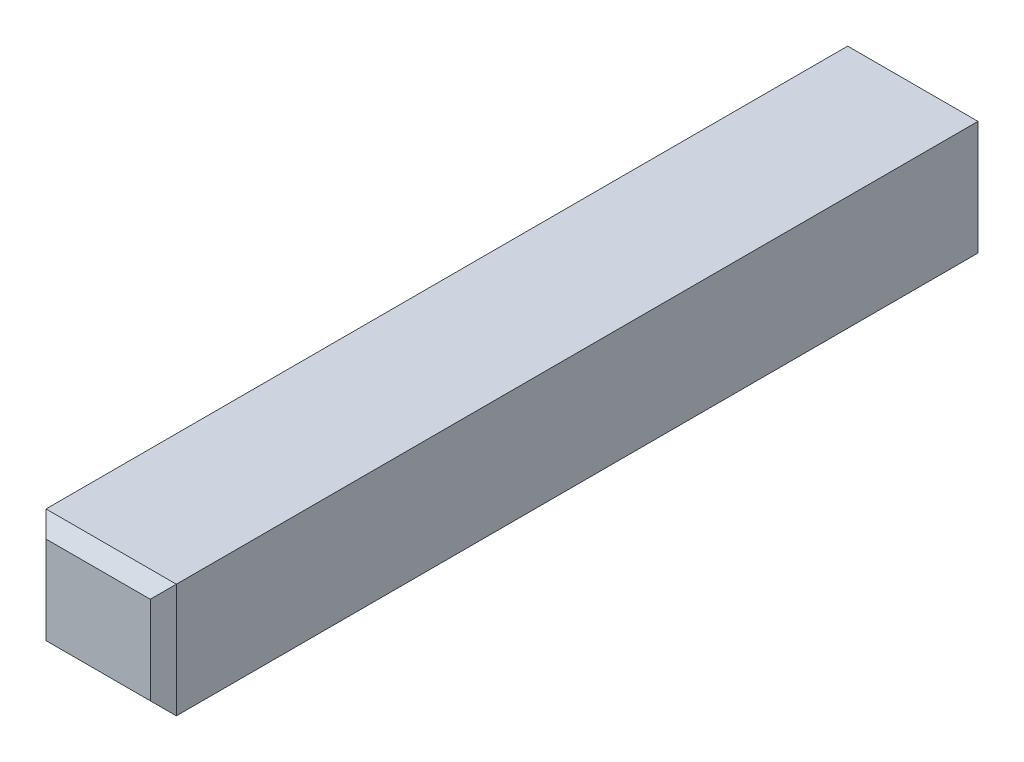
ISO-10303-21;
HEADER;
FILE_DESCRIPTION(('STEP AP214'),'2;1');
FILE_NAME('part.step','',(''),(''),'','','');
FILE_SCHEMA(('AUTOMOTIVE_DESIGN { 1 0 10303 214 1 1 1 1 }'));
ENDSEC;
DATA;
#1=APPLICATION_CONTEXT('core data for automotive mechanical design processes');
#2=APPLICATION_PROTOCOL_DEFINITION('international standard','automotive_design',2000,#1);
#3=PRODUCT_CONTEXT('',#1,'mechanical');
#4=PRODUCT('Part','Part','',(#3));
#5=PRODUCT_RELATED_PRODUCT_CATEGORY('part','',(#4));
#6=PRODUCT_DEFINITION_FORMATION('','',#4);
#7=PRODUCT_DEFINITION_CONTEXT('part definition',#1,'design');
#8=PRODUCT_DEFINITION('design','',#6,#7);
#9=PRODUCT_DEFINITION_SHAPE('','',#8);
#10=(LENGTH_UNIT() NAMED_UNIT(*) SI_UNIT(.MILLI.,.METRE.));
#11=(NAMED_UNIT(*) PLANE_ANGLE_UNIT() SI_UNIT($,.RADIAN.));
#12=(NAMED_UNIT(*) SI_UNIT($,.STERADIAN.) SOLID_ANGLE_UNIT());
#13=UNCERTAINTY_MEASURE_WITH_UNIT(LENGTH_MEASURE(1.E-05),#10,'distance_accuracy_value','');
#14=(GEOMETRIC_REPRESENTATION_CONTEXT(3) GLOBAL_UNCERTAINTY_ASSIGNED_CONTEXT((#13)) GLOBAL_UNIT_ASSIGNED_CONTEXT((#10,
#11,#12)) REPRESENTATION_CONTEXT('',''));
#15=CARTESIAN_POINT('',(0.,0.,0.));
#16=DIRECTION('',(0.,0.,1.));
#17=DIRECTION('',(1.,0.,0.));
#18=AXIS2_PLACEMENT_3D('',#15,#16,#17);
#19=CARTESIAN_POINT('',(4.,-3.5,25.));
#20=DIRECTION('',(-1.,0.,0.));
#21=DIRECTION('',(0.,0.,1.));
#22=AXIS2_PLACEMENT_3D('',#19,#20,#21);
#23=PLANE('',#22);
#24=DIRECTION('',(0.,0.,-1.));
#25=VECTOR('',#24,1.);
#26=CARTESIAN_POINT('',(4.,3.5,25.));
#27=LINE('',#26,#25);
#28=CARTESIAN_POINT('',(4.,3.5,24.2));
#29=VERTEX_POINT('',#28);
#30=CARTESIAN_POINT('',(4.,3.5,-25.));
#31=VERTEX_POINT('',#30);
#32=EDGE_CURVE('E84',#29,#31,#27,.T.);
#33=ORIENTED_EDGE('',*,*,#32,.F.);
#34=DIRECTION('',(0.,-1.,0.));
#35=VECTOR('',#34,1.);
#36=CARTESIAN_POINT('',(4.,-3.5,24.2));
#37=LINE('',#36,#35);
#38=CARTESIAN_POINT('',(4.,-3.5,24.2));
#39=VERTEX_POINT('',#38);
#40=EDGE_CURVE('E11',#29,#39,#37,.T.);
#41=ORIENTED_EDGE('',*,*,#40,.T.);
#42=DIRECTION('',(0.,0.,-1.));
#43=VECTOR('',#42,1.);
#44=CARTESIAN_POINT('',(4.,-3.5,25.));
#45=LINE('',#44,#43);
#46=CARTESIAN_POINT('',(4.,-3.5,-25.));
#47=VERTEX_POINT('',#46);
#48=EDGE_CURVE('E104',#39,#47,#45,.T.);
#49=ORIENTED_EDGE('',*,*,#48,.T.);
#50=DIRECTION('',(0.,1.,0.));
#51=VECTOR('',#50,1.);
#52=CARTESIAN_POINT('',(4.,-3.5,-25.));
#53=LINE('',#52,#51);
#54=EDGE_CURVE('E99',#47,#31,#53,.T.);
#55=ORIENTED_EDGE('',*,*,#54,.T.);
#56=EDGE_LOOP('',(#33,#41,#49,#55));
#57=FACE_BOUND('',#56,.T.);
#58=ADVANCED_FACE('F32',(#57),#23,.F.);
#59=CARTESIAN_POINT('',(-4.,3.5,25.));
#60=DIRECTION('',(0.,-1.,0.));
#61=DIRECTION('',(0.,0.,-1.));
#62=AXIS2_PLACEMENT_3D('',#59,#60,#61);
#63=PLANE('',#62);
#64=DIRECTION('',(0.,0.,-1.));
#65=VECTOR('',#64,1.);
#66=CARTESIAN_POINT('',(-4.,3.5,25.));
#67=LINE('',#66,#65);
#68=CARTESIAN_POINT('',(-4.,3.5,24.2));
#69=VERTEX_POINT('',#68);
#70=CARTESIAN_POINT('',(-4.,3.5,-25.));
#71=VERTEX_POINT('',#70);
#72=EDGE_CURVE('E93',#69,#71,#67,.T.);
#73=ORIENTED_EDGE('',*,*,#72,.F.);
#74=DIRECTION('',(1.,0.,0.));
#75=VECTOR('',#74,1.);
#76=CARTESIAN_POINT('',(-4.,3.5,24.2));
#77=LINE('',#76,#75);
#78=EDGE_CURVE('E41',#69,#29,#77,.T.);
#79=ORIENTED_EDGE('',*,*,#78,.T.);
#80=ORIENTED_EDGE('',*,*,#32,.T.);
#81=DIRECTION('',(-1.,0.,0.));
#82=VECTOR('',#81,1.);
#83=CARTESIAN_POINT('',(-4.,3.5,-25.));
#84=LINE('',#83,#82);
#85=EDGE_CURVE('E87',#31,#71,#84,.T.);
#86=ORIENTED_EDGE('',*,*,#85,.T.);
#87=EDGE_LOOP('',(#73,#79,#80,#86));
#88=FACE_BOUND('',#87,.T.);
#89=ADVANCED_FACE('F86',(#88),#63,.F.);
#90=CARTESIAN_POINT('',(-4.,-3.5,25.));
#91=DIRECTION('',(1.,0.,0.));
#92=DIRECTION('',(0.,0.,-1.));
#93=AXIS2_PLACEMENT_3D('',#90,#91,#92);
#94=PLANE('',#93);
#95=DIRECTION('',(0.,0.,-1.));
#96=VECTOR('',#95,1.);
#97=CARTESIAN_POINT('',(-4.,-3.5,25.));
#98=LINE('',#97,#96);
#99=CARTESIAN_POINT('',(-4.,-3.5,24.2));
#100=VERTEX_POINT('',#99);
#101=CARTESIAN_POINT('',(-4.,-3.5,-25.));
#102=VERTEX_POINT('',#101);
#103=EDGE_CURVE('E114',#100,#102,#98,.T.);
#104=ORIENTED_EDGE('',*,*,#103,.F.);
#105=DIRECTION('',(0.,1.,0.));
#106=VECTOR('',#105,1.);
#107=CARTESIAN_POINT('',(-4.,-3.5,24.2));
#108=LINE('',#107,#106);
#109=EDGE_CURVE('E56',#100,#69,#108,.T.);
#110=ORIENTED_EDGE('',*,*,#109,.T.);
#111=ORIENTED_EDGE('',*,*,#72,.T.);
#112=DIRECTION('',(0.,-1.,0.));
#113=VECTOR('',#112,1.);
#114=CARTESIAN_POINT('',(-4.,-3.5,-25.));
#115=LINE('',#114,#113);
#116=EDGE_CURVE('E101',#71,#102,#115,.T.);
#117=ORIENTED_EDGE('',*,*,#116,.T.);
#118=EDGE_LOOP('',(#104,#110,#111,#117));
#119=FACE_BOUND('',#118,.T.);
#120=ADVANCED_FACE('F152',(#119),#94,.F.);
#121=CARTESIAN_POINT('',(-4.,-3.5,25.));
#122=DIRECTION('',(0.,1.,0.));
#123=DIRECTION('',(0.,0.,1.));
#124=AXIS2_PLACEMENT_3D('',#121,#122,#123);
#125=PLANE('',#124);
#126=ORIENTED_EDGE('',*,*,#48,.F.);
#127=DIRECTION('',(-1.,0.,0.));
#128=VECTOR('',#127,1.);
#129=CARTESIAN_POINT('',(-4.,-3.5,24.2));
#130=LINE('',#129,#128);
#131=EDGE_CURVE('E125',#39,#100,#130,.T.);
#132=ORIENTED_EDGE('',*,*,#131,.T.);
#133=ORIENTED_EDGE('',*,*,#103,.T.);
#134=DIRECTION('',(1.,0.,0.));
#135=VECTOR('',#134,1.);
#136=CARTESIAN_POINT('',(-4.,-3.5,-25.));
#137=LINE('',#136,#135);
#138=EDGE_CURVE('E111',#102,#47,#137,.T.);
#139=ORIENTED_EDGE('',*,*,#138,.T.);
#140=EDGE_LOOP('',(#126,#132,#133,#139));
#141=FACE_BOUND('',#140,.T.);
#142=ADVANCED_FACE('F151',(#141),#125,.F.);
#143=CARTESIAN_POINT('',(0.,0.,25.));
#144=DIRECTION('',(0.,0.,-1.));
#145=DIRECTION('',(-1.,0.,0.));
#146=AXIS2_PLACEMENT_3D('',#143,#144,#145);
#147=PLANE('',#146);
#148=DIRECTION('',(0.,-1.,0.));
#149=VECTOR('',#148,1.);
#150=CARTESIAN_POINT('',(-3.20000000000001,0.,25.));
#151=LINE('',#150,#149);
#152=CARTESIAN_POINT('',(-3.20000000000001,2.70000000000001,25.));
#153=VERTEX_POINT('',#152);
#154=CARTESIAN_POINT('',(-3.20000000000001,-2.70000000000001,25.));
#155=VERTEX_POINT('',#154);
#156=EDGE_CURVE('E120',#153,#155,#151,.T.);
#157=ORIENTED_EDGE('',*,*,#156,.T.);
#158=DIRECTION('',(1.,0.,0.));
#159=VECTOR('',#158,1.);
#160=CARTESIAN_POINT('',(0.,-2.70000000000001,25.));
#161=LINE('',#160,#159);
#162=CARTESIAN_POINT('',(3.20000000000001,-2.70000000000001,25.));
#163=VERTEX_POINT('',#162);
#164=EDGE_CURVE('E122',#155,#163,#161,.T.);
#165=ORIENTED_EDGE('',*,*,#164,.T.);
#166=DIRECTION('',(0.,1.,0.));
#167=VECTOR('',#166,1.);
#168=CARTESIAN_POINT('',(3.20000000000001,0.,25.));
#169=LINE('',#168,#167);
#170=CARTESIAN_POINT('',(3.20000000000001,2.70000000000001,25.));
#171=VERTEX_POINT('',#170);
#172=EDGE_CURVE('E92',#163,#171,#169,.T.);
#173=ORIENTED_EDGE('',*,*,#172,.T.);
#174=DIRECTION('',(-1.,0.,0.));
#175=VECTOR('',#174,1.);
#176=CARTESIAN_POINT('',(0.,2.70000000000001,25.));
#177=LINE('',#176,#175);
#178=EDGE_CURVE('E118',#171,#153,#177,.T.);
#179=ORIENTED_EDGE('',*,*,#178,.T.);
#180=EDGE_LOOP('',(#157,#165,#173,#179));
#181=FACE_BOUND('',#180,.T.);
#182=ADVANCED_FACE('F144',(#181),#147,.F.);
#183=CARTESIAN_POINT('',(0.,0.,-25.));
#184=DIRECTION('',(0.,0.,-1.));
#185=DIRECTION('',(-1.,0.,0.));
#186=AXIS2_PLACEMENT_3D('',#183,#184,#185);
#187=PLANE('',#186);
#188=ORIENTED_EDGE('',*,*,#54,.F.);
#189=ORIENTED_EDGE('',*,*,#138,.F.);
#190=ORIENTED_EDGE('',*,*,#116,.F.);
#191=ORIENTED_EDGE('',*,*,#85,.F.);
#192=EDGE_LOOP('',(#188,#189,#190,#191));
#193=FACE_BOUND('',#192,.T.);
#194=ADVANCED_FACE('F97',(#193),#187,.T.);
#195=CARTESIAN_POINT('',(0.,2.70000000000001,25.));
#196=DIRECTION('',(0.,-0.707106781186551,-0.707106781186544));
#197=DIRECTION('',(-1.,0.,0.));
#198=AXIS2_PLACEMENT_3D('',#195,#196,#197);
#199=PLANE('',#198);
#200=DIRECTION('',(-0.577350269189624,-0.577350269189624,0.577350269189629));
#201=VECTOR('',#200,1.);
#202=CARTESIAN_POINT('',(2.30000000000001,1.80000000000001,25.9));
#203=LINE('',#202,#201);
#204=EDGE_CURVE('E108',#29,#171,#203,.T.);
#205=ORIENTED_EDGE('',*,*,#204,.F.);
#206=ORIENTED_EDGE('',*,*,#78,.F.);
#207=DIRECTION('',(0.577350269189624,-0.577350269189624,0.577350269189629));
#208=VECTOR('',#207,1.);
#209=CARTESIAN_POINT('',(-2.13333333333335,1.63333333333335,26.0666666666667));
#210=LINE('',#209,#208);
#211=EDGE_CURVE('E36',#153,#69,#210,.F.);
#212=ORIENTED_EDGE('',*,*,#211,.F.);
#213=ORIENTED_EDGE('',*,*,#178,.F.);
#214=EDGE_LOOP('',(#205,#206,#212,#213));
#215=FACE_BOUND('',#214,.T.);
#216=ADVANCED_FACE('F34',(#215),#199,.F.);
#217=CARTESIAN_POINT('',(-3.20000000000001,0.,25.));
#218=DIRECTION('',(0.707106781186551,0.,-0.707106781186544));
#219=DIRECTION('',(0.,-1.,0.));
#220=AXIS2_PLACEMENT_3D('',#217,#218,#219);
#221=PLANE('',#220);
#222=ORIENTED_EDGE('',*,*,#211,.T.);
#223=ORIENTED_EDGE('',*,*,#109,.F.);
#224=DIRECTION('',(0.577350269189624,0.577350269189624,0.577350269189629));
#225=VECTOR('',#224,1.);
#226=CARTESIAN_POINT('',(-2.30000000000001,-1.80000000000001,25.9));
#227=LINE('',#226,#225);
#228=EDGE_CURVE('E132',#155,#100,#227,.F.);
#229=ORIENTED_EDGE('',*,*,#228,.F.);
#230=ORIENTED_EDGE('',*,*,#156,.F.);
#231=EDGE_LOOP('',(#222,#223,#229,#230));
#232=FACE_BOUND('',#231,.T.);
#233=ADVANCED_FACE('F169',(#232),#221,.F.);
#234=CARTESIAN_POINT('',(3.20000000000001,0.,25.));
#235=DIRECTION('',(-0.707106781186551,0.,-0.707106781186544));
#236=DIRECTION('',(0.,1.,0.));
#237=AXIS2_PLACEMENT_3D('',#234,#235,#236);
#238=PLANE('',#237);
#239=ORIENTED_EDGE('',*,*,#204,.T.);
#240=ORIENTED_EDGE('',*,*,#172,.F.);
#241=DIRECTION('',(0.577350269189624,-0.577350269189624,-0.577350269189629));
#242=VECTOR('',#241,1.);
#243=CARTESIAN_POINT('',(2.30000000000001,-1.80000000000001,25.9));
#244=LINE('',#243,#242);
#245=EDGE_CURVE('E130',#39,#163,#244,.F.);
#246=ORIENTED_EDGE('',*,*,#245,.F.);
#247=ORIENTED_EDGE('',*,*,#40,.F.);
#248=EDGE_LOOP('',(#239,#240,#246,#247));
#249=FACE_BOUND('',#248,.T.);
#250=ADVANCED_FACE('F137',(#249),#238,.F.);
#251=CARTESIAN_POINT('',(0.,-2.70000000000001,25.));
#252=DIRECTION('',(0.,0.707106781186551,-0.707106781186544));
#253=DIRECTION('',(1.,0.,0.));
#254=AXIS2_PLACEMENT_3D('',#251,#252,#253);
#255=PLANE('',#254);
#256=ORIENTED_EDGE('',*,*,#228,.T.);
#257=ORIENTED_EDGE('',*,*,#131,.F.);
#258=ORIENTED_EDGE('',*,*,#245,.T.);
#259=ORIENTED_EDGE('',*,*,#164,.F.);
#260=EDGE_LOOP('',(#256,#257,#258,#259));
#261=FACE_BOUND('',#260,.T.);
#262=ADVANCED_FACE('F148',(#261),#255,.F.);
#263=CLOSED_SHELL('',(#58,#89,#120,#142,#182,#194,#216,#233,#250,#262));
#264=MANIFOLD_SOLID_BREP('B2',#263);
#265=ADVANCED_BREP_SHAPE_REPRESENTATION('',(#18,#264),#14);
#266=SHAPE_DEFINITION_REPRESENTATION(#9,#265);
ENDSEC;
END-ISO-10303-21;
